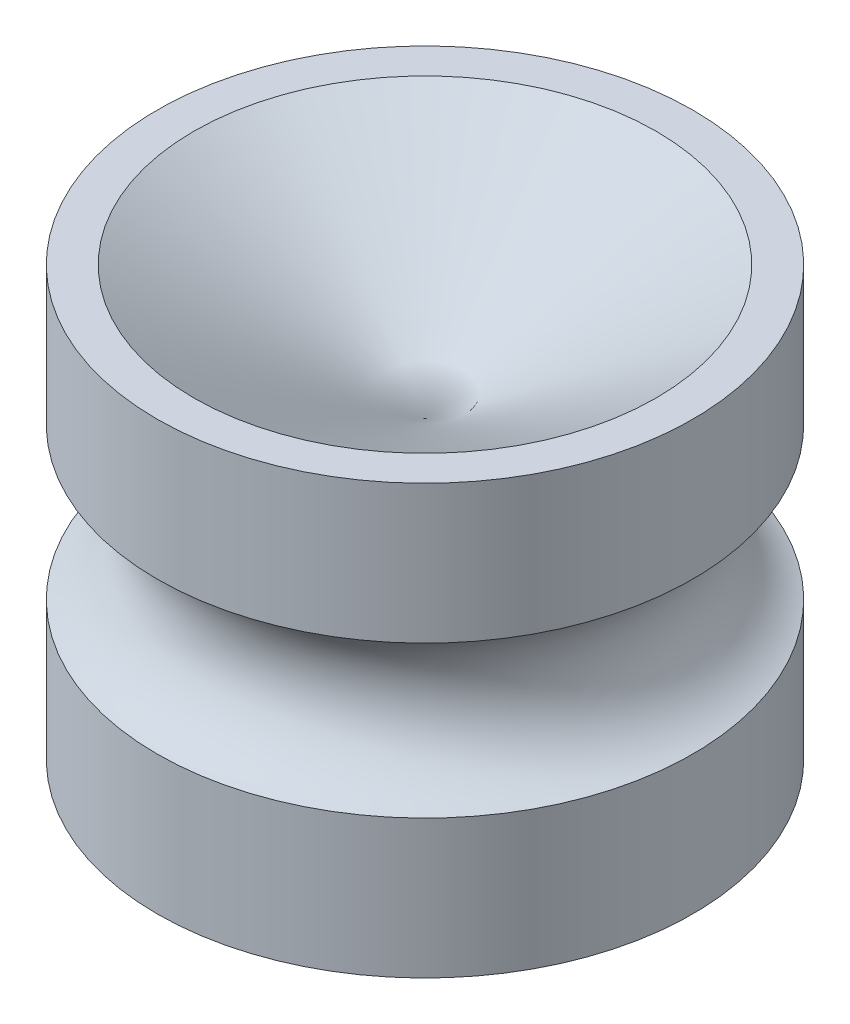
from build123d import *

# Parameters (mm, degrees)
SKETCH2_W = 2.5
SKETCH2_H = 4
SKETCH9_R = 0.75


with BuildPart() as part:
    # Sketch2 → Revolve1 (revolve)
    with BuildSketch(Plane.XY, mode=Mode.PRIVATE) as revolve1_sk:
        with Locations((-1.25, 0)):
            Rectangle(SKETCH2_W, SKETCH2_H)
    revolve(revolve1_sk.sketch.rotate(Axis((0, 50, 0), (0, -1, 0)), 270), axis=Axis((0, 50, 0), (0, -1, 0)))

    # Sketch9 → Cut-Revolve2 (revolve, cut)
    with BuildSketch(Plane.XY, mode=Mode.PRIVATE) as cut_revolve2_sk:
        with Locations((-2.75, 0)):
            Circle(SKETCH9_R)
    revolve(cut_revolve2_sk.sketch.rotate(Axis((0, 50, 0), (0, -1, 0)), 270), axis=Axis((0, 50, 0), (0, -1, 0)), mode=Mode.SUBTRACT)

    # Sketch5 → Cut-Revolve1 (revolve, cut)
    with BuildSketch(Plane.XY, mode=Mode.PRIVATE) as cut_revolve1_sk:
        Polygon((0, 0.754412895), (0, 2), (-2.157420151, 2), align=None)
    revolve(cut_revolve1_sk.sketch.rotate(Axis((0, 50, 0), (0, -1, 0)), 270), axis=Axis((0, 50, 0), (0, -1, 0)), mode=Mode.SUBTRACT)


solid = part.part
